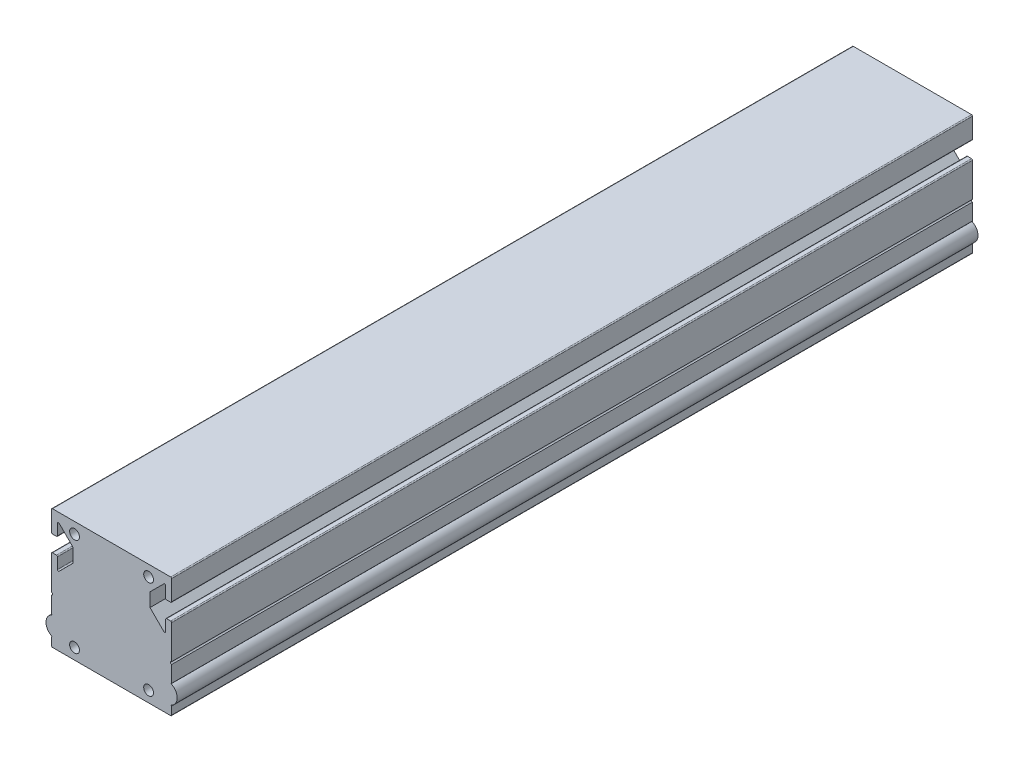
from build123d import *

# Parameters (mm, degrees)
AUSSEN_W                         = 60
AUSSEN_H                         = 60
LINEAR_AUSTRAGEN1_DEPTH          = 400
SCHNITT_LINEAR_AUSTRAGEN2_DEPTH  = 403.243707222
SCHNITT_LINEAR_AUSTRAGEN3_DEPTH  = 403.243707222
SCHNITT_LINEAR_AUSTRAGEN4_DEPTH  = 403.243707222
VERRUNDUNG1_R                    = 0.5
VERRUNDUNG2_R                    = 0.3
F_4_9_4_9_DURCHMESSER_BOHRUNG1_D = 4.9
LINEAR_START                     = -400
SKIZZE9_R                        = 5.05
LINEAR_AUSTRAGEN2_DEPTH          = 400


with BuildPart() as part:
    # Aussen → Linear austragen1 (new body)
    with BuildSketch(Plane.XY):
        Rectangle(AUSSEN_W, AUSSEN_H)
    extrude(amount=LINEAR_AUSTRAGEN1_DEPTH)

    # Markierung → Schnitt-Linear austragen2 (cut, through all)
    with BuildSketch(Plane.XY):
        with BuildLine():
            Line((30, -7.6), (30, -6.4))
            ThreePointArc((30, -6.4), (29.4, -7), (30, -7.6))
        make_face()
    schnitt_linear_austragen2 = extrude(amount=SCHNITT_LINEAR_AUSTRAGEN2_DEPTH, mode=Mode.SUBTRACT)

    # F_hrung → Schnitt-Linear austragen3 (cut, through all)
    with BuildSketch(Plane.XY):
        with BuildLine():
            Line((30, -25.195831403), (30, -16.204168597))
            ThreePointArc((30, -16.204168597), (22.65, -20.7), (30, -25.195831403))
        make_face()
    schnitt_linear_austragen3 = extrude(amount=SCHNITT_LINEAR_AUSTRAGEN3_DEPTH, mode=Mode.SUBTRACT)

    # NUT → Schnitt-Linear austragen4 (cut, through all)
    with BuildSketch(Plane.XY):
        Polygon((30, 10.95), (30, 19.05), (27, 19.05), (27, 26.207106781), (19.2, 18.407106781), (19.2, 11.592893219), (27, 3.792893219), (27, 10.95), align=None)
    schnitt_linear_austragen4 = extrude(amount=SCHNITT_LINEAR_AUSTRAGEN4_DEPTH, mode=Mode.SUBTRACT)

    # Spiegeln2: Schnitt-Linear austragen2, Schnitt-Linear austragen3, Schnitt-Linear austragen4 across plane
    add(schnitt_linear_austragen2.mirror(Plane(origin=(0, 0, 0), x_dir=(0, 0, 1), z_dir=(1, 0, 0))), mode=Mode.SUBTRACT)
    add(schnitt_linear_austragen3.mirror(Plane(origin=(0, 0, 0), x_dir=(0, 0, 1), z_dir=(1, 0, 0))), mode=Mode.SUBTRACT)
    add(schnitt_linear_austragen4.mirror(Plane(origin=(0, 0, 0), x_dir=(0, 0, 1), z_dir=(1, 0, 0))), mode=Mode.SUBTRACT)

    # Verrundung1
    verrundung1_edges = [part.edges().sort_by_distance(p)[0] for p in [
        (27, 10.95, 200),
        (30, 10.95, 200),
        (30, 19.05, 200),
        (27, 19.05, 200),
        (27, 26.207106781, 200),
        (27, 3.792893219, 200),
        (-30, -30, 200),
        (-30, 30, 200),
        (30, 30, 200),
        (30, -30, 200),
        (-30, 10.95, 200),
        (-27, 10.95, 200),
        (-27, 3.792893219, 200),
        (-27, 26.207106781, 200),
        (-27, 19.05, 200),
        (-30, 19.05, 200),
    ]]
    fillet(verrundung1_edges, radius=VERRUNDUNG1_R)

    # Verrundung2
    verrundung2_edges = [part.edges().sort_by_distance(p)[0] for p in [
        (30, -16.204168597, 200),
        (30, -25.195831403, 200),
        (-30, -25.195831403, 200),
        (-30, -16.204168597, 200),
    ]]
    fillet(verrundung2_edges, radius=VERRUNDUNG2_R)

    # 4.9 _4.9_ Durchmesser Bohrung1 (through all)
    with Locations(Plane(origin=(0, 0, 0), x_dir=(-1, 0, 0), z_dir=(0, 0, -1))):
        with Locations((-18.5, 24.5), (18.5, 24.5), (-18.5, -24.5), (18.5, -24.5)):
            Hole(F_4_9_4_9_DURCHMESSER_BOHRUNG1_D / 2)

    # Skizze9 → Linear austragen2 (add)
    with BuildSketch(Plane.XY.offset(400).offset(LINEAR_START)):
        with Locations((-27.7, -20.7)):
            Circle(SKIZZE9_R)
        with Locations((27.7, -20.7)):
            Circle(SKIZZE9_R)
    extrude(amount=LINEAR_AUSTRAGEN2_DEPTH)


solid = part.part
